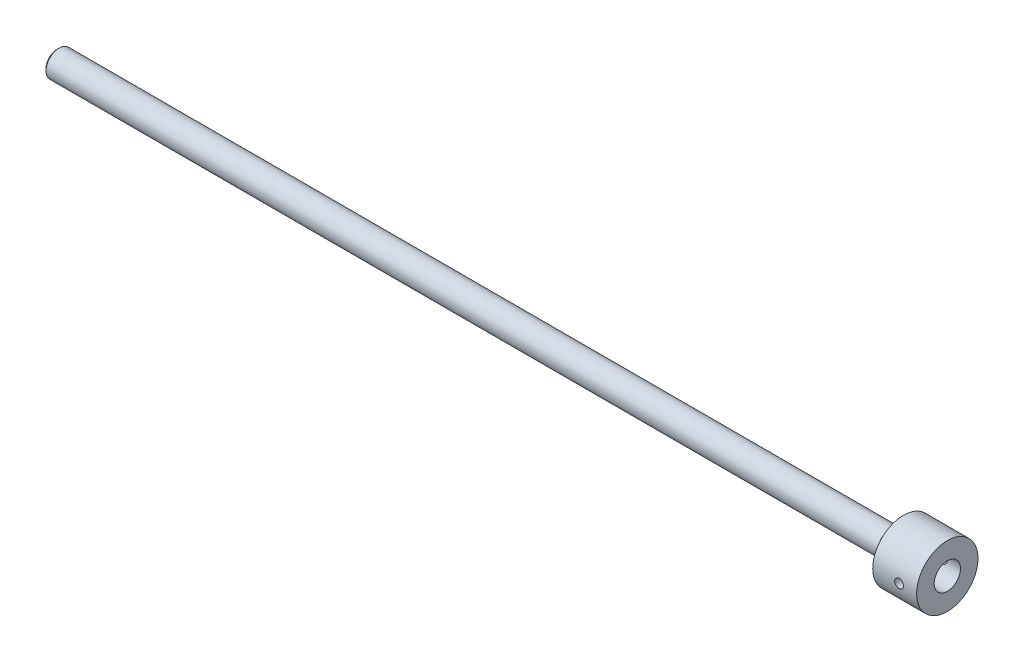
from build123d import *

# Parameters (mm, degrees)
CHANFREIN1_SIZE                   = 0.5
DIAM_TRE_DU_PER_AGE_6_0_6_1_D     = 6
DIAM_TRE_DU_PER_AGE_6_0_6_1_DEPTH = 8
DIAM_TRE_DU_PER_AGE_6_0_6_1_TIP   = 1.802581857
ENL_V_MAT_EXTRU_1_DEPTH           = 30
ENL_V_MAT_EXTRU_1_DEPTH_BACK      = 31
ESQUISSE4_R                       = 1


with BuildPart() as part:
    # Esquisse1 → R_volution1 (revolve)
    with BuildSketch(Plane.XY, mode=Mode.PRIVATE) as r_volution1_sk:
        Polygon((0, 0), (0, 7), (-10, 7), (-11.865230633, 3), (-11.865230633, 2.5), (-12.865230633, 2.5), (-12.865230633, 3), (-202.865230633, 3), (-202.865230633, 0), align=None)
    revolve(r_volution1_sk.sketch.rotate(Axis((-202.865230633, 0, 0), (1, 0, 0)), 90), axis=Axis((-202.865230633, 0, 0), (1, 0, 0)))

    # Chanfrein1
    chanfrein1_edges = [part.edges().sort_by_distance(p)[0] for p in [
        (-202.865230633, 0, -3),
    ]]
    chamfer(chanfrein1_edges, length=CHANFREIN1_SIZE)

    # Diam_tre du per_age _6.0 _6_1
    with Locations(Plane(origin=(0, 0, 0), x_dir=(0, 0, -1), z_dir=(1, 0, 0))):
        with Locations((0, 0)):
            Hole(DIAM_TRE_DU_PER_AGE_6_0_6_1_D / 2, depth=DIAM_TRE_DU_PER_AGE_6_0_6_1_DEPTH)
            with Locations((0, 0, -(DIAM_TRE_DU_PER_AGE_6_0_6_1_DEPTH + DIAM_TRE_DU_PER_AGE_6_0_6_1_TIP / 2))):  # 118° drill point
                Cone(0, DIAM_TRE_DU_PER_AGE_6_0_6_1_D / 2, DIAM_TRE_DU_PER_AGE_6_0_6_1_TIP, mode=Mode.SUBTRACT)

    # Esquisse4 → Enl_v. mat.-Extru.1 (cut, two sides: drawn at the far end of the back side and taken through both)
    with BuildSketch(Plane.XY.offset(-ENL_V_MAT_EXTRU_1_DEPTH_BACK)):
        with Locations((-4, 0)):
            Circle(ESQUISSE4_R)
    extrude(amount=ENL_V_MAT_EXTRU_1_DEPTH + ENL_V_MAT_EXTRU_1_DEPTH_BACK, mode=Mode.SUBTRACT)


solid = part.part
